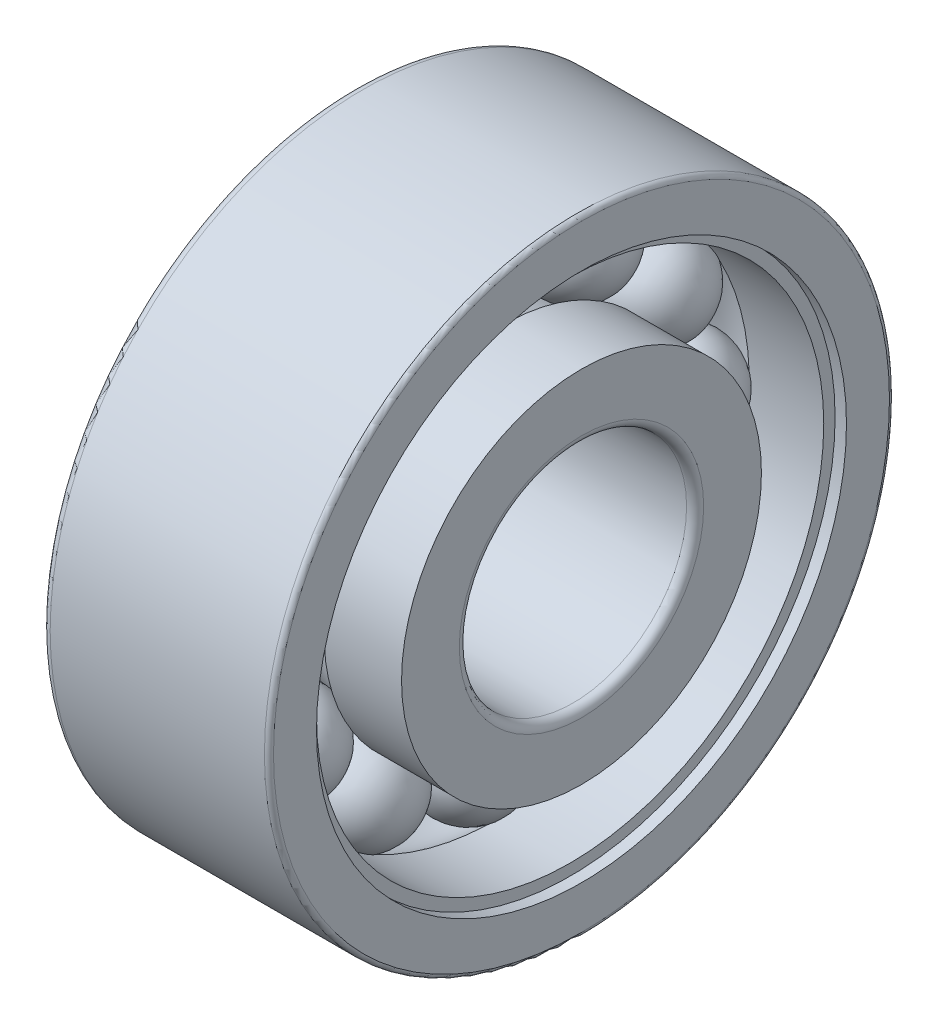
from build123d import *

# Parameters (mm, degrees)
CIRCULAR_PATTERN1_COUNT = 12
FILLET1_R               = 0.15
FILLET2_R               = 0.08


with BuildPart() as part:
    # Sketch1 → Revolve1 (revolve)
    with BuildSketch(Plane.XY):
        with BuildLine():
            Line((-0.875, 3.75), (0.875, 3.75))
            ThreePointArc((0.875, 3.75), (0, 2.875), (-0.875, 3.75))
        make_face()
    revolve1 = revolve(axis=Axis((-3.091912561, 3.75, 0), (1, 0, 0)))

    # Sketch2 → Revolve2 (revolve)
    with BuildSketch(Plane.XY, mode=Mode.PRIVATE) as revolve2_sk:
        with BuildLine():
            Line((-2, 3.166666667), (-0.638707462, 3.166666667))
            ThreePointArc((-0.638707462, 3.166666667), (0, 2.885), (0.638707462, 3.166666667))
            Line((0.638707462, 3.166666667), (2, 3.166666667))
            Line((2, 3.166666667), (2, 2))
            Line((2, 2), (-2, 2))
            Line((-2, 2), (-2, 3.166666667))
        make_face()
    revolve(revolve2_sk.sketch.rotate(Axis((-2.992358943, 0, 0), (1, 0, 0)), 90), axis=Axis((-2.992358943, 0, 0), (1, 0, 0)))

    # Sketch3 → Revolve3 (revolve)
    with BuildSketch(Plane.XY, mode=Mode.PRIVATE) as revolve3_sk:
        with BuildLine():
            Line((-2, 4.333333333), (-2, 5.5))
            Line((-2, 5.5), (2, 5.5))
            Line((2, 5.5), (2, 4.663333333))
            Line((2, 4.663333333), (1.8, 4.663333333))
            Line((1.8, 4.663333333), (1.8, 4.463333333))
            Line((1.8, 4.463333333), (0.489265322, 4.463333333))
            ThreePointArc((0.489265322, 4.463333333), (-0.09903655, 4.609311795), (-0.638707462, 4.333333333))
            Line((-0.638707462, 4.333333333), (-2, 4.333333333))
        make_face()
    revolve(revolve3_sk.sketch.rotate(Axis((-2.992358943, 0, 0), (1, 0, 0)), 90), axis=Axis((-2.992358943, 0, 0), (1, 0, 0)))

    # Circular-Pattern1: Revolve1 ×12 about axis
    circular_pattern1_axis = Axis((0, 0, 0), (1, 0, 0))
    for i in range(1, CIRCULAR_PATTERN1_COUNT):
        add(revolve1.rotate(circular_pattern1_axis, i * 360 / CIRCULAR_PATTERN1_COUNT))

    # Fillet1
    fillet1_edges = [part.edges().sort_by_distance(p)[0] for p in [
        (-2, 0, -5.5),
        (2, 0, -2),
    ]]
    fillet(fillet1_edges, radius=FILLET1_R)

    # Fillet2
    fillet2_edges = [part.edges().sort_by_distance(p)[0] for p in [
        (2, 0, -5.5),
        (-2, 0, -2),
    ]]
    fillet(fillet2_edges, radius=FILLET2_R)


solid = part.part
